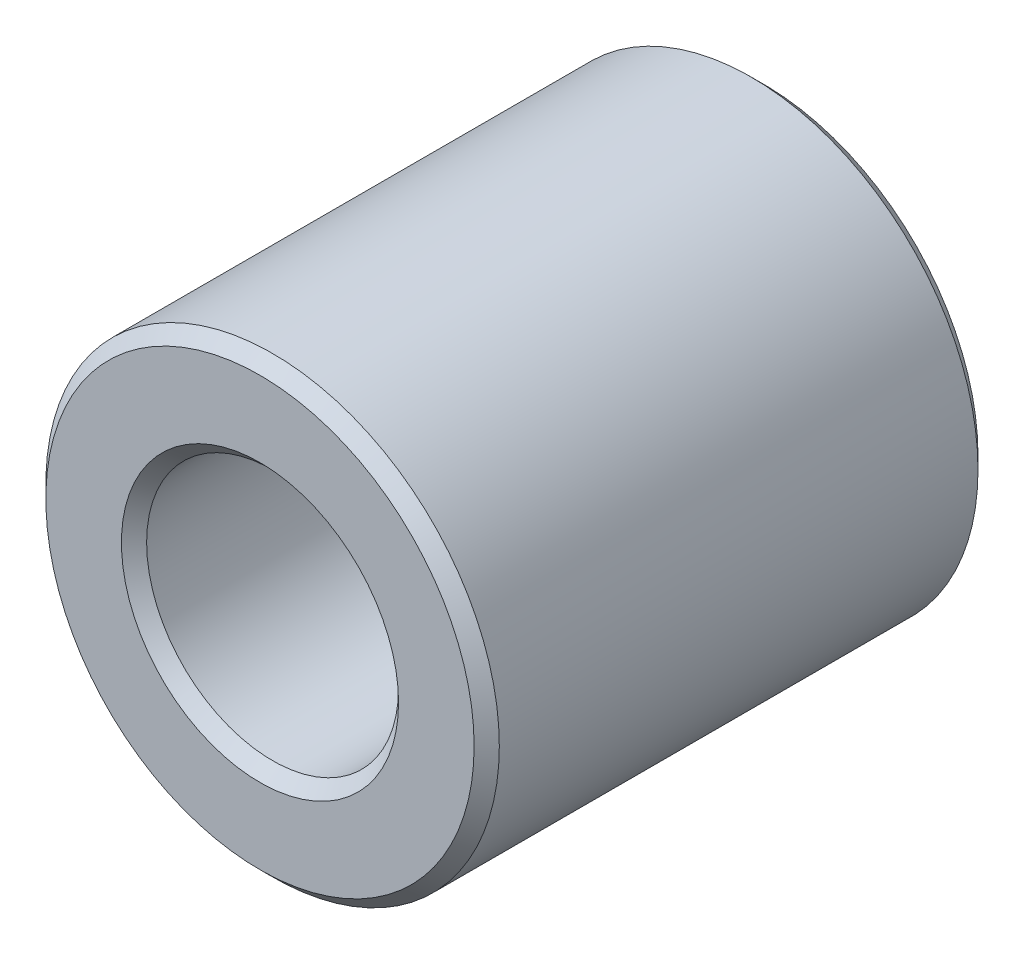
ISO-10303-21;
HEADER;
FILE_DESCRIPTION(('STEP AP214'),'2;1');
FILE_NAME('part.step','',(''),(''),'','','');
FILE_SCHEMA(('AUTOMOTIVE_DESIGN { 1 0 10303 214 1 1 1 1 }'));
ENDSEC;
DATA;
#1=APPLICATION_CONTEXT('core data for automotive mechanical design processes');
#2=APPLICATION_PROTOCOL_DEFINITION('international standard','automotive_design',2000,#1);
#3=PRODUCT_CONTEXT('',#1,'mechanical');
#4=PRODUCT('Part','Part','',(#3));
#5=PRODUCT_RELATED_PRODUCT_CATEGORY('part','',(#4));
#6=PRODUCT_DEFINITION_FORMATION('','',#4);
#7=PRODUCT_DEFINITION_CONTEXT('part definition',#1,'design');
#8=PRODUCT_DEFINITION('design','',#6,#7);
#9=PRODUCT_DEFINITION_SHAPE('','',#8);
#10=(LENGTH_UNIT() NAMED_UNIT(*) SI_UNIT(.MILLI.,.METRE.));
#11=(NAMED_UNIT(*) PLANE_ANGLE_UNIT() SI_UNIT($,.RADIAN.));
#12=(NAMED_UNIT(*) SI_UNIT($,.STERADIAN.) SOLID_ANGLE_UNIT());
#13=UNCERTAINTY_MEASURE_WITH_UNIT(LENGTH_MEASURE(1.E-05),#10,'distance_accuracy_value','');
#14=(GEOMETRIC_REPRESENTATION_CONTEXT(3) GLOBAL_UNCERTAINTY_ASSIGNED_CONTEXT((#13)) GLOBAL_UNIT_ASSIGNED_CONTEXT((#10,
#11,#12)) REPRESENTATION_CONTEXT('',''));
#15=CARTESIAN_POINT('',(0.,0.,0.));
#16=DIRECTION('',(0.,0.,1.));
#17=DIRECTION('',(1.,0.,0.));
#18=AXIS2_PLACEMENT_3D('',#15,#16,#17);
#19=CARTESIAN_POINT('',(0.,0.,50.));
#20=DIRECTION('',(0.,0.,1.));
#21=DIRECTION('',(1.,0.,0.));
#22=AXIS2_PLACEMENT_3D('',#19,#20,#21);
#23=PLANE('',#22);
#24=CARTESIAN_POINT('',(0.,0.,50.));
#25=DIRECTION('',(0.,0.,1.));
#26=DIRECTION('',(1.,0.,0.));
#27=AXIS2_PLACEMENT_3D('',#24,#25,#26);
#28=CIRCLE('',#27,27.5);
#29=CARTESIAN_POINT('',(27.5,0.,50.));
#30=VERTEX_POINT('',#29);
#31=EDGE_CURVE('E10',#30,#30,#28,.F.);
#32=ORIENTED_EDGE('',*,*,#31,.T.);
#33=EDGE_LOOP('',(#32));
#34=FACE_BOUND('',#33,.T.);
#35=CARTESIAN_POINT('',(0.,0.,50.));
#36=DIRECTION('',(0.,0.,1.));
#37=DIRECTION('',(1.,0.,0.));
#38=AXIS2_PLACEMENT_3D('',#35,#36,#37);
#39=CIRCLE('',#38,42.5);
#40=CARTESIAN_POINT('',(42.5,0.,50.));
#41=VERTEX_POINT('',#40);
#42=EDGE_CURVE('E45',#41,#41,#39,.T.);
#43=ORIENTED_EDGE('',*,*,#42,.T.);
#44=EDGE_LOOP('',(#43));
#45=FACE_BOUND('',#44,.T.);
#46=ADVANCED_FACE('F37',(#34,#45),#23,.T.);
#47=CARTESIAN_POINT('',(0.,0.,-50.));
#48=DIRECTION('',(0.,0.,1.));
#49=DIRECTION('',(1.,0.,0.));
#50=AXIS2_PLACEMENT_3D('',#47,#48,#49);
#51=PLANE('',#50);
#52=CARTESIAN_POINT('',(0.,0.,-50.));
#53=DIRECTION('',(0.,0.,1.));
#54=DIRECTION('',(1.,0.,0.));
#55=AXIS2_PLACEMENT_3D('',#52,#53,#54);
#56=CIRCLE('',#55,27.5);
#57=CARTESIAN_POINT('',(27.5,0.,-50.));
#58=VERTEX_POINT('',#57);
#59=EDGE_CURVE('E70',#58,#58,#56,.T.);
#60=ORIENTED_EDGE('',*,*,#59,.T.);
#61=EDGE_LOOP('',(#60));
#62=FACE_BOUND('',#61,.T.);
#63=CARTESIAN_POINT('',(0.,0.,-50.));
#64=DIRECTION('',(0.,0.,1.));
#65=DIRECTION('',(1.,0.,0.));
#66=AXIS2_PLACEMENT_3D('',#63,#64,#65);
#67=CIRCLE('',#66,42.5);
#68=CARTESIAN_POINT('',(42.5,0.,-50.));
#69=VERTEX_POINT('',#68);
#70=EDGE_CURVE('E73',#69,#69,#67,.F.);
#71=ORIENTED_EDGE('',*,*,#70,.T.);
#72=EDGE_LOOP('',(#71));
#73=FACE_BOUND('',#72,.T.);
#74=ADVANCED_FACE('F78',(#62,#73),#51,.F.);
#75=CARTESIAN_POINT('',(0.,0.,50.));
#76=DIRECTION('',(0.,0.,-1.));
#77=DIRECTION('',(-1.,0.,0.));
#78=AXIS2_PLACEMENT_3D('',#75,#76,#77);
#79=CYLINDRICAL_SURFACE('',#78,45.);
#80=CARTESIAN_POINT('',(0.,0.,-47.5));
#81=DIRECTION('',(0.,0.,1.));
#82=DIRECTION('',(1.,0.,0.));
#83=AXIS2_PLACEMENT_3D('',#80,#81,#82);
#84=CIRCLE('',#83,45.);
#85=CARTESIAN_POINT('',(45.,0.,-47.5));
#86=VERTEX_POINT('',#85);
#87=EDGE_CURVE('E52',#86,#86,#84,.T.);
#88=ORIENTED_EDGE('',*,*,#87,.T.);
#89=EDGE_LOOP('',(#88));
#90=FACE_BOUND('',#89,.T.);
#91=CARTESIAN_POINT('',(0.,0.,47.5));
#92=DIRECTION('',(0.,0.,1.));
#93=DIRECTION('',(1.,0.,0.));
#94=AXIS2_PLACEMENT_3D('',#91,#92,#93);
#95=CIRCLE('',#94,45.);
#96=CARTESIAN_POINT('',(45.,0.,47.5));
#97=VERTEX_POINT('',#96);
#98=EDGE_CURVE('E58',#97,#97,#95,.F.);
#99=ORIENTED_EDGE('',*,*,#98,.T.);
#100=EDGE_LOOP('',(#99));
#101=FACE_BOUND('',#100,.T.);
#102=ADVANCED_FACE('F88',(#90,#101),#79,.T.);
#103=CARTESIAN_POINT('',(0.,0.,50.));
#104=DIRECTION('',(0.,0.,-1.));
#105=DIRECTION('',(-1.,0.,0.));
#106=AXIS2_PLACEMENT_3D('',#103,#104,#105);
#107=CYLINDRICAL_SURFACE('',#106,25.);
#108=CARTESIAN_POINT('',(0.,0.,-47.5));
#109=DIRECTION('',(0.,0.,1.));
#110=DIRECTION('',(1.,0.,0.));
#111=AXIS2_PLACEMENT_3D('',#108,#109,#110);
#112=CIRCLE('',#111,25.);
#113=CARTESIAN_POINT('',(25.,0.,-47.5));
#114=VERTEX_POINT('',#113);
#115=EDGE_CURVE('E63',#114,#114,#112,.F.);
#116=ORIENTED_EDGE('',*,*,#115,.T.);
#117=EDGE_LOOP('',(#116));
#118=FACE_BOUND('',#117,.T.);
#119=CARTESIAN_POINT('',(0.,0.,47.5));
#120=DIRECTION('',(0.,0.,1.));
#121=DIRECTION('',(1.,0.,0.));
#122=AXIS2_PLACEMENT_3D('',#119,#120,#121);
#123=CIRCLE('',#122,25.);
#124=CARTESIAN_POINT('',(25.,0.,47.5));
#125=VERTEX_POINT('',#124);
#126=EDGE_CURVE('E67',#125,#125,#123,.T.);
#127=ORIENTED_EDGE('',*,*,#126,.T.);
#128=EDGE_LOOP('',(#127));
#129=FACE_BOUND('',#128,.T.);
#130=ADVANCED_FACE('F91',(#118,#129),#107,.F.);
#131=CARTESIAN_POINT('',(0.,0.,-50.));
#132=DIRECTION('',(0.,0.,-1.));
#133=DIRECTION('',(-1.,0.,0.));
#134=AXIS2_PLACEMENT_3D('',#131,#132,#133);
#135=CONICAL_SURFACE('',#134,27.5,0.785398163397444);
#136=ORIENTED_EDGE('',*,*,#115,.F.);
#137=EDGE_LOOP('',(#136));
#138=FACE_BOUND('',#137,.T.);
#139=ORIENTED_EDGE('',*,*,#59,.F.);
#140=EDGE_LOOP('',(#139));
#141=FACE_BOUND('',#140,.T.);
#142=ADVANCED_FACE('F84',(#138,#141),#135,.F.);
#143=CARTESIAN_POINT('',(0.,0.,-47.5));
#144=DIRECTION('',(0.,0.,1.));
#145=DIRECTION('',(1.,0.,0.));
#146=AXIS2_PLACEMENT_3D('',#143,#144,#145);
#147=CONICAL_SURFACE('',#146,45.,0.785398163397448);
#148=ORIENTED_EDGE('',*,*,#70,.F.);
#149=EDGE_LOOP('',(#148));
#150=FACE_BOUND('',#149,.T.);
#151=ORIENTED_EDGE('',*,*,#87,.F.);
#152=EDGE_LOOP('',(#151));
#153=FACE_BOUND('',#152,.T.);
#154=ADVANCED_FACE('F80',(#150,#153),#147,.T.);
#155=CARTESIAN_POINT('',(0.,0.,47.5));
#156=DIRECTION('',(0.,0.,1.));
#157=DIRECTION('',(1.,0.,0.));
#158=AXIS2_PLACEMENT_3D('',#155,#156,#157);
#159=CONICAL_SURFACE('',#158,25.,0.785398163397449);
#160=CARTESIAN_POINT('',(27.5,0.,50.));
#161=CARTESIAN_POINT('',(27.4739583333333,0.,49.9739583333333));
#162=CARTESIAN_POINT('',(27.4479166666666,0.,49.9479166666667));
#163=CARTESIAN_POINT('',(27.3958333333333,0.,49.8958333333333));
#164=CARTESIAN_POINT('',(27.3697916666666,0.,49.8697916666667));
#165=CARTESIAN_POINT('',(27.3177083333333,0.,49.8177083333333));
#166=CARTESIAN_POINT('',(27.2916666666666,0.,49.7916666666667));
#167=CARTESIAN_POINT('',(27.2395833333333,0.,49.7395833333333));
#168=CARTESIAN_POINT('',(27.2135416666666,0.,49.7135416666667));
#169=CARTESIAN_POINT('',(27.1614583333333,0.,49.6614583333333));
#170=CARTESIAN_POINT('',(27.1354166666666,0.,49.6354166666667));
#171=CARTESIAN_POINT('',(27.0833333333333,0.,49.5833333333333));
#172=CARTESIAN_POINT('',(27.0572916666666,0.,49.5572916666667));
#173=CARTESIAN_POINT('',(27.0052083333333,0.,49.5052083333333));
#174=CARTESIAN_POINT('',(26.9791666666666,0.,49.4791666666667));
#175=CARTESIAN_POINT('',(26.9270833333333,0.,49.4270833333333));
#176=CARTESIAN_POINT('',(26.9010416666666,0.,49.4010416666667));
#177=CARTESIAN_POINT('',(26.8489583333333,0.,49.3489583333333));
#178=CARTESIAN_POINT('',(26.8229166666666,0.,49.3229166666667));
#179=CARTESIAN_POINT('',(26.7708333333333,0.,49.2708333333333));
#180=CARTESIAN_POINT('',(26.7447916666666,0.,49.2447916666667));
#181=CARTESIAN_POINT('',(26.6927083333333,0.,49.1927083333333));
#182=CARTESIAN_POINT('',(26.6666666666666,0.,49.1666666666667));
#183=CARTESIAN_POINT('',(26.6145833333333,0.,49.1145833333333));
#184=CARTESIAN_POINT('',(26.5885416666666,0.,49.0885416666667));
#185=CARTESIAN_POINT('',(26.5364583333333,0.,49.0364583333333));
#186=CARTESIAN_POINT('',(26.5104166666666,0.,49.0104166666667));
#187=CARTESIAN_POINT('',(26.4583333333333,0.,48.9583333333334));
#188=CARTESIAN_POINT('',(26.4322916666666,0.,48.9322916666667));
#189=CARTESIAN_POINT('',(26.3802083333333,0.,48.8802083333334));
#190=CARTESIAN_POINT('',(26.3541666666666,0.,48.8541666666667));
#191=CARTESIAN_POINT('',(26.3020833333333,0.,48.8020833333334));
#192=CARTESIAN_POINT('',(26.2760416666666,0.,48.7760416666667));
#193=CARTESIAN_POINT('',(26.2239583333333,0.,48.7239583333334));
#194=CARTESIAN_POINT('',(26.1979166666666,0.,48.6979166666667));
#195=CARTESIAN_POINT('',(26.1458333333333,0.,48.6458333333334));
#196=CARTESIAN_POINT('',(26.1197916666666,0.,48.6197916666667));
#197=CARTESIAN_POINT('',(26.0677083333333,0.,48.5677083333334));
#198=CARTESIAN_POINT('',(26.0416666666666,0.,48.5416666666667));
#199=CARTESIAN_POINT('',(25.9895833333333,0.,48.4895833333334));
#200=CARTESIAN_POINT('',(25.9635416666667,0.,48.4635416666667));
#201=CARTESIAN_POINT('',(25.9114583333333,0.,48.4114583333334));
#202=CARTESIAN_POINT('',(25.8854166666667,0.,48.3854166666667));
#203=CARTESIAN_POINT('',(25.8333333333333,0.,48.3333333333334));
#204=CARTESIAN_POINT('',(25.8072916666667,0.,48.3072916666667));
#205=CARTESIAN_POINT('',(25.7552083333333,0.,48.2552083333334));
#206=CARTESIAN_POINT('',(25.7291666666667,0.,48.2291666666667));
#207=CARTESIAN_POINT('',(25.6770833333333,0.,48.1770833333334));
#208=CARTESIAN_POINT('',(25.6510416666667,0.,48.1510416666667));
#209=CARTESIAN_POINT('',(25.5989583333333,0.,48.0989583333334));
#210=CARTESIAN_POINT('',(25.5729166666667,0.,48.0729166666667));
#211=CARTESIAN_POINT('',(25.5208333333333,0.,48.0208333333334));
#212=CARTESIAN_POINT('',(25.4947916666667,0.,47.9947916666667));
#213=CARTESIAN_POINT('',(25.4427083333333,0.,47.9427083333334));
#214=CARTESIAN_POINT('',(25.4166666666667,0.,47.9166666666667));
#215=CARTESIAN_POINT('',(25.3645833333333,0.,47.8645833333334));
#216=CARTESIAN_POINT('',(25.3385416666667,0.,47.8385416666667));
#217=CARTESIAN_POINT('',(25.2864583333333,0.,47.7864583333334));
#218=CARTESIAN_POINT('',(25.2604166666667,0.,47.7604166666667));
#219=CARTESIAN_POINT('',(25.2083333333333,0.,47.7083333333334));
#220=CARTESIAN_POINT('',(25.1822916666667,0.,47.6822916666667));
#221=CARTESIAN_POINT('',(25.1302083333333,0.,47.6302083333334));
#222=CARTESIAN_POINT('',(25.1041666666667,0.,47.6041666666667));
#223=CARTESIAN_POINT('',(25.0520833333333,0.,47.5520833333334));
#224=CARTESIAN_POINT('',(25.0260416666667,0.,47.5260416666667));
#225=CARTESIAN_POINT('',(25.,0.,47.5));
#226=B_SPLINE_CURVE_WITH_KNOTS('',3,(#160,#161,#162,#163,#164,#165,#166,#167,#168,#169,#170,
#171,#172,#173,#174,#175,#176,#177,#178,#179,#180,#181,#182,#183,#184,#185,#186,#187,#188,#189,
#190,#191,#192,#193,#194,#195,#196,#197,#198,#199,#200,#201,#202,#203,#204,#205,#206,#207,#208,
#209,#210,#211,#212,#213,#214,#215,#216,#217,#218,#219,#220,#221,#222,#223,#224,#225),
.UNSPECIFIED.,.F.,.F.,(4,2,2,2,2,2,2,2,2,2,2,2,2,2,2,2,2,2,2,2,2,2,2,2,2,2,2,2,2,2,2,2,4),(0.,
0.110485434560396,0.220970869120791,0.331456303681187,0.441941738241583,0.552427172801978,
0.662912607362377,0.773398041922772,0.883883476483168,0.994368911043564,1.10485434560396,
1.21533978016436,1.32582521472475,1.43631064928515,1.54679608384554,1.65728151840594,
1.76776695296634,1.87825238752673,1.98873782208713,2.09922325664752,2.20970869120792,
2.32019412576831,2.43067956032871,2.54116499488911,2.6516504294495,2.7621358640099,
2.87262129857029,2.98310673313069,3.09359216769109,3.20407760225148,3.31456303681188,
3.42504847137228,3.53553390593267),.UNSPECIFIED.);
#227=EDGE_CURVE('BSEAM83',#30,#125,#226,.T.);
#228=ORIENTED_EDGE('',*,*,#31,.F.);
#229=ORIENTED_EDGE('',*,*,#126,.F.);
#230=ORIENTED_EDGE('',*,*,#227,.T.);
#231=ORIENTED_EDGE('',*,*,#227,.F.);
#232=EDGE_LOOP('',(#228,#230,#229,#231));
#233=FACE_BOUND('',#232,.T.);
#234=ADVANCED_FACE('F83',(#233),#159,.F.);
#235=CARTESIAN_POINT('',(0.,0.,50.));
#236=DIRECTION('',(0.,0.,-1.));
#237=DIRECTION('',(-1.,0.,0.));
#238=AXIS2_PLACEMENT_3D('',#235,#236,#237);
#239=CONICAL_SURFACE('',#238,42.5,0.78539816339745);
#240=ORIENTED_EDGE('',*,*,#98,.F.);
#241=EDGE_LOOP('',(#240));
#242=FACE_BOUND('',#241,.T.);
#243=ORIENTED_EDGE('',*,*,#42,.F.);
#244=EDGE_LOOP('',(#243));
#245=FACE_BOUND('',#244,.T.);
#246=ADVANCED_FACE('F39',(#242,#245),#239,.T.);
#247=CLOSED_SHELL('',(#46,#74,#102,#130,#142,#154,#234,#246));
#248=MANIFOLD_SOLID_BREP('B2',#247);
#249=ADVANCED_BREP_SHAPE_REPRESENTATION('',(#18,#248),#14);
#250=SHAPE_DEFINITION_REPRESENTATION(#9,#249);
ENDSEC;
END-ISO-10303-21;
